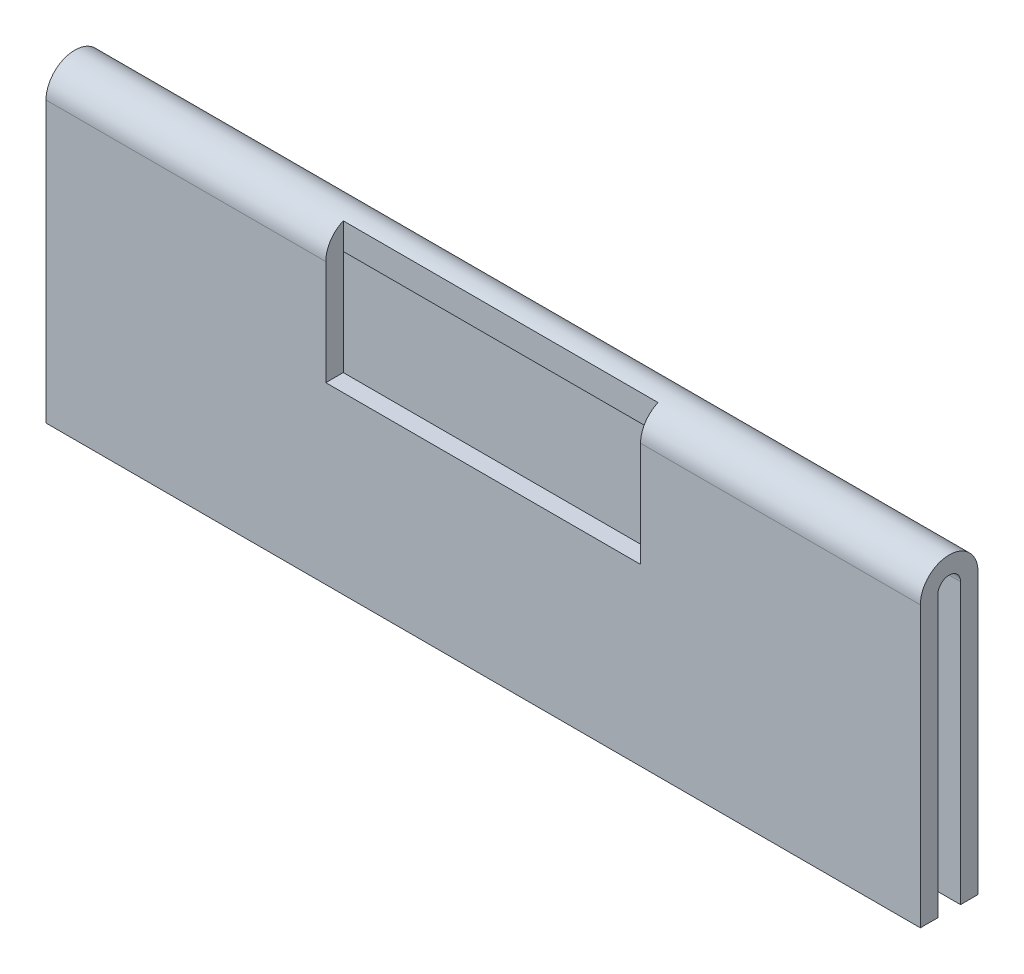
ISO-10303-21;
HEADER;
FILE_DESCRIPTION(('STEP AP214'),'2;1');
FILE_NAME('part.step','',(''),(''),'','','');
FILE_SCHEMA(('AUTOMOTIVE_DESIGN { 1 0 10303 214 1 1 1 1 }'));
ENDSEC;
DATA;
#1=APPLICATION_CONTEXT('core data for automotive mechanical design processes');
#2=APPLICATION_PROTOCOL_DEFINITION('international standard','automotive_design',2000,#1);
#3=PRODUCT_CONTEXT('',#1,'mechanical');
#4=PRODUCT('Part','Part','',(#3));
#5=PRODUCT_RELATED_PRODUCT_CATEGORY('part','',(#4));
#6=PRODUCT_DEFINITION_FORMATION('','',#4);
#7=PRODUCT_DEFINITION_CONTEXT('part definition',#1,'design');
#8=PRODUCT_DEFINITION('design','',#6,#7);
#9=PRODUCT_DEFINITION_SHAPE('','',#8);
#10=(LENGTH_UNIT() NAMED_UNIT(*) SI_UNIT(.MILLI.,.METRE.));
#11=(NAMED_UNIT(*) PLANE_ANGLE_UNIT() SI_UNIT($,.RADIAN.));
#12=(NAMED_UNIT(*) SI_UNIT($,.STERADIAN.) SOLID_ANGLE_UNIT());
#13=UNCERTAINTY_MEASURE_WITH_UNIT(LENGTH_MEASURE(1.E-05),#10,'distance_accuracy_value','');
#14=(GEOMETRIC_REPRESENTATION_CONTEXT(3) GLOBAL_UNCERTAINTY_ASSIGNED_CONTEXT((#13)) GLOBAL_UNIT_ASSIGNED_CONTEXT((#10,
#11,#12)) REPRESENTATION_CONTEXT('',''));
#15=CARTESIAN_POINT('',(0.,0.,0.));
#16=DIRECTION('',(0.,0.,1.));
#17=DIRECTION('',(1.,0.,0.));
#18=AXIS2_PLACEMENT_3D('',#15,#16,#17);
#19=CARTESIAN_POINT('',(-125.,40.,5.));
#20=DIRECTION('',(1.,0.,0.));
#21=DIRECTION('',(0.,0.,-1.));
#22=AXIS2_PLACEMENT_3D('',#19,#20,#21);
#23=PLANE('',#22);
#24=DIRECTION('',(0.,-1.,0.));
#25=VECTOR('',#24,1.);
#26=CARTESIAN_POINT('',(-125.,40.,0.));
#27=LINE('',#26,#25);
#28=CARTESIAN_POINT('',(-125.,40.,0.));
#29=VERTEX_POINT('',#28);
#30=CARTESIAN_POINT('',(-125.,-40.,0.));
#31=VERTEX_POINT('',#30);
#32=EDGE_CURVE('E198',#29,#31,#27,.T.);
#33=ORIENTED_EDGE('',*,*,#32,.T.);
#34=DIRECTION('',(0.,0.,-1.));
#35=VECTOR('',#34,1.);
#36=CARTESIAN_POINT('',(-125.,-40.,5.));
#37=LINE('',#36,#35);
#38=CARTESIAN_POINT('',(-125.,-40.,5.));
#39=VERTEX_POINT('',#38);
#40=EDGE_CURVE('E220',#39,#31,#37,.T.);
#41=ORIENTED_EDGE('',*,*,#40,.F.);
#42=DIRECTION('',(0.,-1.,0.));
#43=VECTOR('',#42,1.);
#44=CARTESIAN_POINT('',(-125.,40.,5.));
#45=LINE('',#44,#43);
#46=CARTESIAN_POINT('',(-125.,40.,5.));
#47=VERTEX_POINT('',#46);
#48=EDGE_CURVE('E199',#47,#39,#45,.T.);
#49=ORIENTED_EDGE('',*,*,#48,.F.);
#50=CARTESIAN_POINT('',(-125.,40.,8.2418151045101));
#51=DIRECTION('',(-1.,0.,0.));
#52=DIRECTION('',(0.,-1.,0.));
#53=AXIS2_PLACEMENT_3D('',#50,#51,#52);
#54=CIRCLE('',#53,3.2418151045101);
#55=CARTESIAN_POINT('',(-125.,40.,11.4836302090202));
#56=VERTEX_POINT('',#55);
#57=EDGE_CURVE('E186',#56,#47,#54,.T.);
#58=ORIENTED_EDGE('',*,*,#57,.F.);
#59=DIRECTION('',(0.,1.,0.));
#60=VECTOR('',#59,1.);
#61=CARTESIAN_POINT('',(-125.,-40.,11.4836302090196));
#62=LINE('',#61,#60);
#63=CARTESIAN_POINT('',(-125.,-40.,11.4836302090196));
#64=VERTEX_POINT('',#63);
#65=EDGE_CURVE('E177',#64,#56,#62,.T.);
#66=ORIENTED_EDGE('',*,*,#65,.F.);
#67=DIRECTION('',(0.,0.,-1.));
#68=VECTOR('',#67,1.);
#69=CARTESIAN_POINT('',(-125.,-40.0000000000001,16.4836302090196));
#70=LINE('',#69,#68);
#71=CARTESIAN_POINT('',(-125.,-40.0000000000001,16.4836302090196));
#72=VERTEX_POINT('',#71);
#73=EDGE_CURVE('E159',#72,#64,#70,.T.);
#74=ORIENTED_EDGE('',*,*,#73,.F.);
#75=DIRECTION('',(0.,1.,0.));
#76=VECTOR('',#75,1.);
#77=CARTESIAN_POINT('',(-125.,-40.0000000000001,16.4836302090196));
#78=LINE('',#77,#76);
#79=CARTESIAN_POINT('',(-125.,39.9999999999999,16.4836302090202));
#80=VERTEX_POINT('',#79);
#81=EDGE_CURVE('E168',#72,#80,#78,.T.);
#82=ORIENTED_EDGE('',*,*,#81,.T.);
#83=CARTESIAN_POINT('',(-125.,40.,8.2418151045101));
#84=DIRECTION('',(-1.,0.,0.));
#85=DIRECTION('',(0.,-1.,0.));
#86=AXIS2_PLACEMENT_3D('',#83,#84,#85);
#87=CIRCLE('',#86,8.2418151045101);
#88=EDGE_CURVE('E195',#80,#29,#87,.T.);
#89=ORIENTED_EDGE('',*,*,#88,.T.);
#90=EDGE_LOOP('',(#33,#41,#49,#58,#66,#74,#82,#89));
#91=FACE_BOUND('',#90,.T.);
#92=ADVANCED_FACE('F33',(#91),#23,.F.);
#93=CARTESIAN_POINT('',(-125.,-40.,5.));
#94=DIRECTION('',(0.,1.,0.));
#95=DIRECTION('',(-1.,0.,0.));
#96=AXIS2_PLACEMENT_3D('',#93,#94,#95);
#97=PLANE('',#96);
#98=DIRECTION('',(1.,0.,0.));
#99=VECTOR('',#98,1.);
#100=CARTESIAN_POINT('',(-125.,-40.,0.));
#101=LINE('',#100,#99);
#102=CARTESIAN_POINT('',(125.,-40.,0.));
#103=VERTEX_POINT('',#102);
#104=EDGE_CURVE('E212',#31,#103,#101,.T.);
#105=ORIENTED_EDGE('',*,*,#104,.T.);
#106=DIRECTION('',(0.,0.,-1.));
#107=VECTOR('',#106,1.);
#108=CARTESIAN_POINT('',(125.,-40.,5.));
#109=LINE('',#108,#107);
#110=CARTESIAN_POINT('',(125.,-40.,5.));
#111=VERTEX_POINT('',#110);
#112=EDGE_CURVE('E209',#111,#103,#109,.T.);
#113=ORIENTED_EDGE('',*,*,#112,.F.);
#114=DIRECTION('',(1.,0.,0.));
#115=VECTOR('',#114,1.);
#116=CARTESIAN_POINT('',(-125.,-40.,5.));
#117=LINE('',#116,#115);
#118=EDGE_CURVE('E202',#39,#111,#117,.T.);
#119=ORIENTED_EDGE('',*,*,#118,.F.);
#120=ORIENTED_EDGE('',*,*,#40,.T.);
#121=EDGE_LOOP('',(#105,#113,#119,#120));
#122=FACE_BOUND('',#121,.T.);
#123=ADVANCED_FACE('F258',(#122),#97,.F.);
#124=CARTESIAN_POINT('',(125.,40.,5.));
#125=DIRECTION('',(-1.,0.,0.));
#126=DIRECTION('',(0.,-1.,0.));
#127=AXIS2_PLACEMENT_3D('',#124,#125,#126);
#128=PLANE('',#127);
#129=DIRECTION('',(0.,1.,0.));
#130=VECTOR('',#129,1.);
#131=CARTESIAN_POINT('',(125.,40.,0.));
#132=LINE('',#131,#130);
#133=CARTESIAN_POINT('',(125.,40.,0.));
#134=VERTEX_POINT('',#133);
#135=EDGE_CURVE('E214',#103,#134,#132,.T.);
#136=ORIENTED_EDGE('',*,*,#135,.T.);
#137=CARTESIAN_POINT('',(125.,40.,8.2418151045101));
#138=DIRECTION('',(-1.,0.,0.));
#139=DIRECTION('',(0.,-1.,0.));
#140=AXIS2_PLACEMENT_3D('',#137,#138,#139);
#141=CIRCLE('',#140,8.2418151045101);
#142=CARTESIAN_POINT('',(125.,39.9999999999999,16.4836302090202));
#143=VERTEX_POINT('',#142);
#144=EDGE_CURVE('E192',#143,#134,#141,.T.);
#145=ORIENTED_EDGE('',*,*,#144,.F.);
#146=DIRECTION('',(0.,1.,0.));
#147=VECTOR('',#146,1.);
#148=CARTESIAN_POINT('',(125.,-40.0000000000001,16.4836302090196));
#149=LINE('',#148,#147);
#150=CARTESIAN_POINT('',(125.,-40.0000000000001,16.4836302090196));
#151=VERTEX_POINT('',#150);
#152=EDGE_CURVE('E171',#151,#143,#149,.T.);
#153=ORIENTED_EDGE('',*,*,#152,.F.);
#154=DIRECTION('',(0.,0.,1.));
#155=VECTOR('',#154,1.);
#156=CARTESIAN_POINT('',(125.,-40.0000000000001,16.4836302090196));
#157=LINE('',#156,#155);
#158=CARTESIAN_POINT('',(125.,-40.,11.4836302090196));
#159=VERTEX_POINT('',#158);
#160=EDGE_CURVE('E164',#159,#151,#157,.T.);
#161=ORIENTED_EDGE('',*,*,#160,.F.);
#162=DIRECTION('',(0.,1.,0.));
#163=VECTOR('',#162,1.);
#164=CARTESIAN_POINT('',(125.,-40.,11.4836302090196));
#165=LINE('',#164,#163);
#166=CARTESIAN_POINT('',(125.,40.,11.4836302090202));
#167=VERTEX_POINT('',#166);
#168=EDGE_CURVE('E174',#159,#167,#165,.T.);
#169=ORIENTED_EDGE('',*,*,#168,.T.);
#170=CARTESIAN_POINT('',(125.,40.,8.2418151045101));
#171=DIRECTION('',(-1.,0.,0.));
#172=DIRECTION('',(0.,-1.,0.));
#173=AXIS2_PLACEMENT_3D('',#170,#171,#172);
#174=CIRCLE('',#173,3.2418151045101);
#175=CARTESIAN_POINT('',(125.,40.,5.));
#176=VERTEX_POINT('',#175);
#177=EDGE_CURVE('E189',#167,#176,#174,.T.);
#178=ORIENTED_EDGE('',*,*,#177,.T.);
#179=DIRECTION('',(0.,1.,0.));
#180=VECTOR('',#179,1.);
#181=CARTESIAN_POINT('',(125.,40.,5.));
#182=LINE('',#181,#180);
#183=EDGE_CURVE('E205',#111,#176,#182,.T.);
#184=ORIENTED_EDGE('',*,*,#183,.F.);
#185=ORIENTED_EDGE('',*,*,#112,.T.);
#186=EDGE_LOOP('',(#136,#145,#153,#161,#169,#178,#184,#185));
#187=FACE_BOUND('',#186,.T.);
#188=ADVANCED_FACE('F249',(#187),#128,.F.);
#189=CARTESIAN_POINT('',(0.,0.,5.));
#190=DIRECTION('',(0.,0.,1.));
#191=DIRECTION('',(1.,0.,0.));
#192=AXIS2_PLACEMENT_3D('',#189,#190,#191);
#193=PLANE('',#192);
#194=ORIENTED_EDGE('',*,*,#48,.T.);
#195=ORIENTED_EDGE('',*,*,#118,.T.);
#196=ORIENTED_EDGE('',*,*,#183,.T.);
#197=DIRECTION('',(-1.,0.,0.));
#198=VECTOR('',#197,1.);
#199=CARTESIAN_POINT('',(-125.,40.,5.));
#200=LINE('',#199,#198);
#201=EDGE_CURVE('E207',#176,#47,#200,.T.);
#202=ORIENTED_EDGE('',*,*,#201,.T.);
#203=EDGE_LOOP('',(#194,#195,#196,#202));
#204=FACE_BOUND('',#203,.T.);
#205=ADVANCED_FACE('F260',(#204),#193,.T.);
#206=CARTESIAN_POINT('',(0.,0.,0.));
#207=DIRECTION('',(0.,0.,1.));
#208=DIRECTION('',(1.,0.,0.));
#209=AXIS2_PLACEMENT_3D('',#206,#207,#208);
#210=PLANE('',#209);
#211=ORIENTED_EDGE('',*,*,#32,.F.);
#212=DIRECTION('',(-1.,0.,0.));
#213=VECTOR('',#212,1.);
#214=CARTESIAN_POINT('',(-125.,40.,0.));
#215=LINE('',#214,#213);
#216=EDGE_CURVE('E203',#134,#29,#215,.T.);
#217=ORIENTED_EDGE('',*,*,#216,.F.);
#218=ORIENTED_EDGE('',*,*,#135,.F.);
#219=ORIENTED_EDGE('',*,*,#104,.F.);
#220=EDGE_LOOP('',(#211,#217,#218,#219));
#221=FACE_BOUND('',#220,.T.);
#222=ADVANCED_FACE('F254',(#221),#210,.F.);
#223=CARTESIAN_POINT('',(-125.,40.,8.2418151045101));
#224=DIRECTION('',(-1.,0.,0.));
#225=DIRECTION('',(0.,-1.,0.));
#226=AXIS2_PLACEMENT_3D('',#223,#224,#225);
#227=CYLINDRICAL_SURFACE('',#226,8.2418151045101);
#228=DIRECTION('',(-1.,0.,0.));
#229=VECTOR('',#228,1.);
#230=CARTESIAN_POINT('',(-125.,39.9999999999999,16.4836302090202));
#231=LINE('',#230,#229);
#232=CARTESIAN_POINT('',(-45.,39.9999999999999,16.4836302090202));
#233=VERTEX_POINT('',#232);
#234=EDGE_CURVE('E181',#233,#80,#231,.T.);
#235=ORIENTED_EDGE('',*,*,#234,.F.);
#236=CARTESIAN_POINT('',(-45.,40.,8.2418151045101));
#237=DIRECTION('',(-1.,0.,0.));
#238=DIRECTION('',(0.,-1.,0.));
#239=AXIS2_PLACEMENT_3D('',#236,#237,#238);
#240=CIRCLE('',#239,8.2418151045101);
#241=CARTESIAN_POINT('',(-45.,47.5774765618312,11.4836302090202));
#242=VERTEX_POINT('',#241);
#243=EDGE_CURVE('E152',#233,#242,#240,.T.);
#244=ORIENTED_EDGE('',*,*,#243,.T.);
#245=DIRECTION('',(-1.,0.,0.));
#246=VECTOR('',#245,1.);
#247=CARTESIAN_POINT('',(-125.,47.5774765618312,11.4836302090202));
#248=LINE('',#247,#246);
#249=CARTESIAN_POINT('',(45.,47.5774765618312,11.4836302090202));
#250=VERTEX_POINT('',#249);
#251=EDGE_CURVE('E156',#242,#250,#248,.F.);
#252=ORIENTED_EDGE('',*,*,#251,.T.);
#253=CARTESIAN_POINT('',(45.,40.,8.2418151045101));
#254=DIRECTION('',(1.,0.,0.));
#255=DIRECTION('',(0.,0.,-1.));
#256=AXIS2_PLACEMENT_3D('',#253,#254,#255);
#257=CIRCLE('',#256,8.2418151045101);
#258=CARTESIAN_POINT('',(45.,39.9999999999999,16.4836302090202));
#259=VERTEX_POINT('',#258);
#260=EDGE_CURVE('E149',#250,#259,#257,.T.);
#261=ORIENTED_EDGE('',*,*,#260,.T.);
#262=EDGE_CURVE('E183',#143,#259,#231,.T.);
#263=ORIENTED_EDGE('',*,*,#262,.F.);
#264=ORIENTED_EDGE('',*,*,#144,.T.);
#265=ORIENTED_EDGE('',*,*,#216,.T.);
#266=ORIENTED_EDGE('',*,*,#88,.F.);
#267=EDGE_LOOP('',(#235,#244,#252,#261,#263,#264,#265,#266));
#268=FACE_BOUND('',#267,.T.);
#269=ADVANCED_FACE('F232',(#268),#227,.T.);
#270=CARTESIAN_POINT('',(-125.,40.,8.2418151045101));
#271=DIRECTION('',(-1.,0.,0.));
#272=DIRECTION('',(0.,-1.,0.));
#273=AXIS2_PLACEMENT_3D('',#270,#271,#272);
#274=CYLINDRICAL_SURFACE('',#273,3.2418151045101);
#275=DIRECTION('',(1.,0.,0.));
#276=VECTOR('',#275,1.);
#277=CARTESIAN_POINT('',(-125.,40.,11.4836302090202));
#278=LINE('',#277,#276);
#279=CARTESIAN_POINT('',(-45.,40.,11.4836302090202));
#280=VERTEX_POINT('',#279);
#281=EDGE_CURVE('E141',#56,#280,#278,.T.);
#282=ORIENTED_EDGE('',*,*,#281,.F.);
#283=ORIENTED_EDGE('',*,*,#57,.T.);
#284=ORIENTED_EDGE('',*,*,#201,.F.);
#285=ORIENTED_EDGE('',*,*,#177,.F.);
#286=CARTESIAN_POINT('',(45.,40.,11.4836302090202));
#287=VERTEX_POINT('',#286);
#288=EDGE_CURVE('E179',#287,#167,#278,.T.);
#289=ORIENTED_EDGE('',*,*,#288,.F.);
#290=EDGE_CURVE('E182',#280,#287,#278,.T.);
#291=ORIENTED_EDGE('',*,*,#290,.F.);
#292=EDGE_LOOP('',(#282,#283,#284,#285,#289,#291));
#293=FACE_BOUND('',#292,.T.);
#294=ADVANCED_FACE('F264',(#293),#274,.F.);
#295=CARTESIAN_POINT('',(-125.,-40.,11.4836302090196));
#296=DIRECTION('',(0.,0.,1.));
#297=DIRECTION('',(0.,-1.,0.));
#298=AXIS2_PLACEMENT_3D('',#295,#296,#297);
#299=PLANE('',#298);
#300=ORIENTED_EDGE('',*,*,#281,.T.);
#301=DIRECTION('',(0.,-1.,0.));
#302=VECTOR('',#301,1.);
#303=CARTESIAN_POINT('',(-45.,90.,11.4836302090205));
#304=LINE('',#303,#302);
#305=CARTESIAN_POINT('',(-45.,9.99999999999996,11.48363020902));
#306=VERTEX_POINT('',#305);
#307=EDGE_CURVE('E133',#280,#306,#304,.T.);
#308=ORIENTED_EDGE('',*,*,#307,.T.);
#309=DIRECTION('',(1.,0.,0.));
#310=VECTOR('',#309,1.);
#311=CARTESIAN_POINT('',(-45.,9.99999999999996,11.48363020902));
#312=LINE('',#311,#310);
#313=CARTESIAN_POINT('',(45.,9.99999999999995,11.48363020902));
#314=VERTEX_POINT('',#313);
#315=EDGE_CURVE('E124',#306,#314,#312,.T.);
#316=ORIENTED_EDGE('',*,*,#315,.T.);
#317=DIRECTION('',(0.,-1.,0.));
#318=VECTOR('',#317,1.);
#319=CARTESIAN_POINT('',(45.,90.,11.4836302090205));
#320=LINE('',#319,#318);
#321=EDGE_CURVE('E145',#287,#314,#320,.T.);
#322=ORIENTED_EDGE('',*,*,#321,.F.);
#323=ORIENTED_EDGE('',*,*,#288,.T.);
#324=ORIENTED_EDGE('',*,*,#168,.F.);
#325=DIRECTION('',(1.,0.,0.));
#326=VECTOR('',#325,1.);
#327=CARTESIAN_POINT('',(-125.,-40.,11.4836302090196));
#328=LINE('',#327,#326);
#329=EDGE_CURVE('E162',#64,#159,#328,.T.);
#330=ORIENTED_EDGE('',*,*,#329,.F.);
#331=ORIENTED_EDGE('',*,*,#65,.T.);
#332=EDGE_LOOP('',(#300,#308,#316,#322,#323,#324,#330,#331));
#333=FACE_BOUND('',#332,.T.);
#334=ADVANCED_FACE('F138',(#333),#299,.F.);
#335=CARTESIAN_POINT('',(-125.,-40.0000000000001,16.4836302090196));
#336=DIRECTION('',(0.,0.,-1.));
#337=DIRECTION('',(0.,1.,0.));
#338=AXIS2_PLACEMENT_3D('',#335,#336,#337);
#339=PLANE('',#338);
#340=DIRECTION('',(-1.,0.,0.));
#341=VECTOR('',#340,1.);
#342=CARTESIAN_POINT('',(-45.,9.99999999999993,16.48363020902));
#343=LINE('',#342,#341);
#344=CARTESIAN_POINT('',(45.,9.99999999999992,16.48363020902));
#345=VERTEX_POINT('',#344);
#346=CARTESIAN_POINT('',(-45.,9.99999999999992,16.48363020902));
#347=VERTEX_POINT('',#346);
#348=EDGE_CURVE('E143',#345,#347,#343,.T.);
#349=ORIENTED_EDGE('',*,*,#348,.T.);
#350=DIRECTION('',(0.,1.,0.));
#351=VECTOR('',#350,1.);
#352=CARTESIAN_POINT('',(-45.,-40.0000000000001,16.4836302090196));
#353=LINE('',#352,#351);
#354=EDGE_CURVE('E11',#347,#233,#353,.T.);
#355=ORIENTED_EDGE('',*,*,#354,.T.);
#356=ORIENTED_EDGE('',*,*,#234,.T.);
#357=ORIENTED_EDGE('',*,*,#81,.F.);
#358=DIRECTION('',(-1.,0.,0.));
#359=VECTOR('',#358,1.);
#360=CARTESIAN_POINT('',(-125.,-40.0000000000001,16.4836302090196));
#361=LINE('',#360,#359);
#362=EDGE_CURVE('E166',#151,#72,#361,.T.);
#363=ORIENTED_EDGE('',*,*,#362,.F.);
#364=ORIENTED_EDGE('',*,*,#152,.T.);
#365=ORIENTED_EDGE('',*,*,#262,.T.);
#366=DIRECTION('',(0.,-1.,0.));
#367=VECTOR('',#366,1.);
#368=CARTESIAN_POINT('',(45.,-40.0000000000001,16.4836302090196));
#369=LINE('',#368,#367);
#370=EDGE_CURVE('E40',#259,#345,#369,.T.);
#371=ORIENTED_EDGE('',*,*,#370,.T.);
#372=EDGE_LOOP('',(#349,#355,#356,#357,#363,#364,#365,#371));
#373=FACE_BOUND('',#372,.T.);
#374=ADVANCED_FACE('F224',(#373),#339,.F.);
#375=CARTESIAN_POINT('',(0.,-40.,-2.81081258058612E-13));
#376=DIRECTION('',(0.,-1.,0.));
#377=DIRECTION('',(0.,0.,-1.));
#378=AXIS2_PLACEMENT_3D('',#375,#376,#377);
#379=PLANE('',#378);
#380=ORIENTED_EDGE('',*,*,#73,.T.);
#381=ORIENTED_EDGE('',*,*,#329,.T.);
#382=ORIENTED_EDGE('',*,*,#160,.T.);
#383=ORIENTED_EDGE('',*,*,#362,.T.);
#384=EDGE_LOOP('',(#380,#381,#382,#383));
#385=FACE_BOUND('',#384,.T.);
#386=ADVANCED_FACE('F245',(#385),#379,.T.);
#387=CARTESIAN_POINT('',(-45.,90.,11.4836302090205));
#388=DIRECTION('',(0.,0.,-1.));
#389=DIRECTION('',(0.,1.,0.));
#390=AXIS2_PLACEMENT_3D('',#387,#388,#389);
#391=PLANE('',#390);
#392=EDGE_CURVE('E142',#242,#280,#304,.T.);
#393=ORIENTED_EDGE('',*,*,#392,.T.);
#394=ORIENTED_EDGE('',*,*,#290,.T.);
#395=EDGE_CURVE('E153',#250,#287,#320,.T.);
#396=ORIENTED_EDGE('',*,*,#395,.F.);
#397=ORIENTED_EDGE('',*,*,#251,.F.);
#398=EDGE_LOOP('',(#393,#394,#396,#397));
#399=FACE_BOUND('',#398,.T.);
#400=ADVANCED_FACE('F234',(#399),#391,.F.);
#401=CARTESIAN_POINT('',(-45.,89.9999999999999,16.4836302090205));
#402=DIRECTION('',(-1.,0.,0.));
#403=DIRECTION('',(0.,-1.,0.));
#404=AXIS2_PLACEMENT_3D('',#401,#402,#403);
#405=PLANE('',#404);
#406=ORIENTED_EDGE('',*,*,#354,.F.);
#407=DIRECTION('',(0.,0.,-1.));
#408=VECTOR('',#407,1.);
#409=CARTESIAN_POINT('',(-45.,9.99999999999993,16.48363020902));
#410=LINE('',#409,#408);
#411=EDGE_CURVE('E52',#347,#306,#410,.T.);
#412=ORIENTED_EDGE('',*,*,#411,.T.);
#413=ORIENTED_EDGE('',*,*,#307,.F.);
#414=ORIENTED_EDGE('',*,*,#392,.F.);
#415=ORIENTED_EDGE('',*,*,#243,.F.);
#416=EDGE_LOOP('',(#406,#412,#413,#414,#415));
#417=FACE_BOUND('',#416,.T.);
#418=ADVANCED_FACE('F131',(#417),#405,.F.);
#419=CARTESIAN_POINT('',(45.,89.9999999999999,16.4836302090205));
#420=DIRECTION('',(1.,0.,0.));
#421=DIRECTION('',(0.,0.,-1.));
#422=AXIS2_PLACEMENT_3D('',#419,#420,#421);
#423=PLANE('',#422);
#424=ORIENTED_EDGE('',*,*,#395,.T.);
#425=ORIENTED_EDGE('',*,*,#321,.T.);
#426=DIRECTION('',(0.,0.,1.));
#427=VECTOR('',#426,1.);
#428=CARTESIAN_POINT('',(45.,9.99999999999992,16.48363020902));
#429=LINE('',#428,#427);
#430=EDGE_CURVE('E47',#314,#345,#429,.T.);
#431=ORIENTED_EDGE('',*,*,#430,.T.);
#432=ORIENTED_EDGE('',*,*,#370,.F.);
#433=ORIENTED_EDGE('',*,*,#260,.F.);
#434=EDGE_LOOP('',(#424,#425,#431,#432,#433));
#435=FACE_BOUND('',#434,.T.);
#436=ADVANCED_FACE('F228',(#435),#423,.F.);
#437=CARTESIAN_POINT('',(0.,10.,0.));
#438=DIRECTION('',(0.,-1.,0.));
#439=DIRECTION('',(0.,0.,-1.));
#440=AXIS2_PLACEMENT_3D('',#437,#438,#439);
#441=PLANE('',#440);
#442=ORIENTED_EDGE('',*,*,#411,.F.);
#443=ORIENTED_EDGE('',*,*,#348,.F.);
#444=ORIENTED_EDGE('',*,*,#430,.F.);
#445=ORIENTED_EDGE('',*,*,#315,.F.);
#446=EDGE_LOOP('',(#442,#443,#444,#445));
#447=FACE_BOUND('',#446,.T.);
#448=ADVANCED_FACE('F125',(#447),#441,.F.);
#449=CLOSED_SHELL('',(#92,#123,#188,#205,#222,#269,#294,#334,#374,#386,#400,#418,#436,#448));
#450=MANIFOLD_SOLID_BREP('B2',#449);
#451=ADVANCED_BREP_SHAPE_REPRESENTATION('',(#18,#450),#14);
#452=SHAPE_DEFINITION_REPRESENTATION(#9,#451);
ENDSEC;
END-ISO-10303-21;
